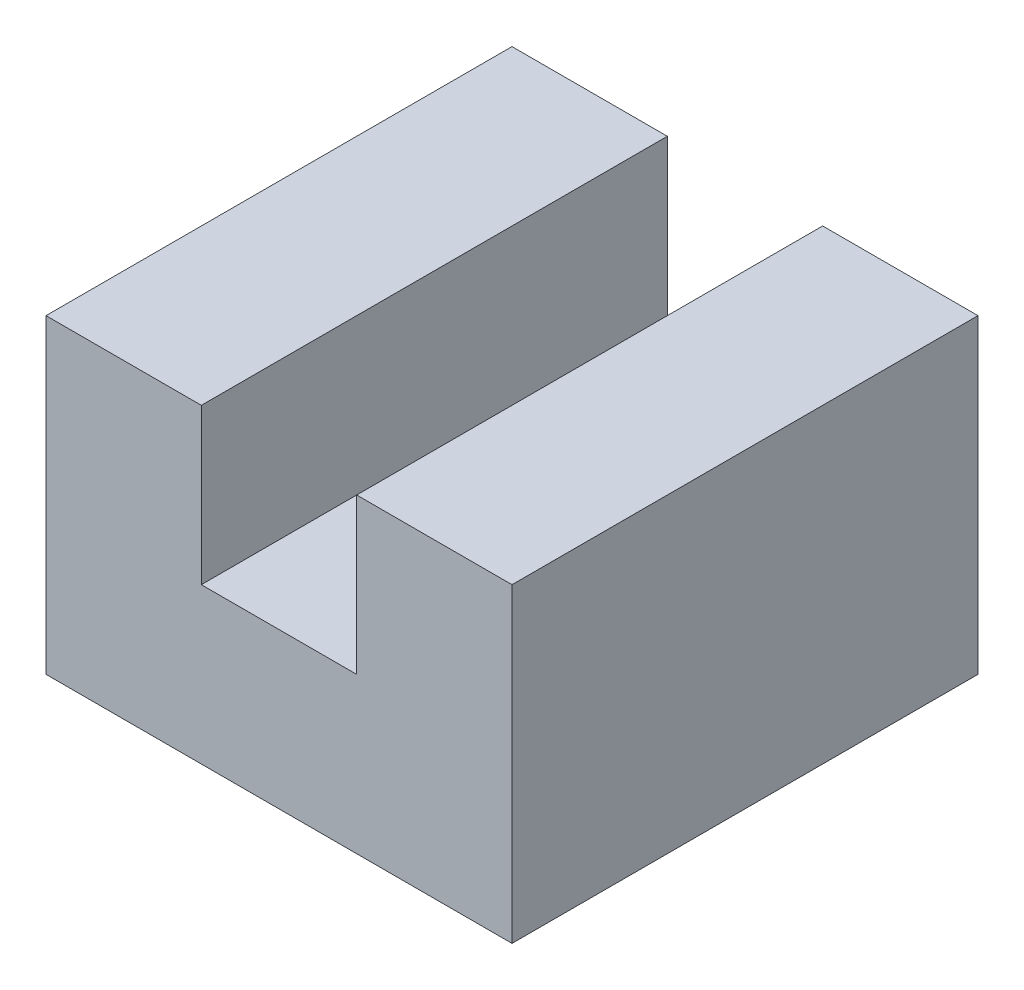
ISO-10303-21;
HEADER;
FILE_DESCRIPTION(('STEP AP214'),'2;1');
FILE_NAME('part.step','',(''),(''),'','','');
FILE_SCHEMA(('AUTOMOTIVE_DESIGN { 1 0 10303 214 1 1 1 1 }'));
ENDSEC;
DATA;
#1=APPLICATION_CONTEXT('core data for automotive mechanical design processes');
#2=APPLICATION_PROTOCOL_DEFINITION('international standard','automotive_design',2000,#1);
#3=PRODUCT_CONTEXT('',#1,'mechanical');
#4=PRODUCT('Part','Part','',(#3));
#5=PRODUCT_RELATED_PRODUCT_CATEGORY('part','',(#4));
#6=PRODUCT_DEFINITION_FORMATION('','',#4);
#7=PRODUCT_DEFINITION_CONTEXT('part definition',#1,'design');
#8=PRODUCT_DEFINITION('design','',#6,#7);
#9=PRODUCT_DEFINITION_SHAPE('','',#8);
#10=(LENGTH_UNIT() NAMED_UNIT(*) SI_UNIT(.MILLI.,.METRE.));
#11=(NAMED_UNIT(*) PLANE_ANGLE_UNIT() SI_UNIT($,.RADIAN.));
#12=(NAMED_UNIT(*) SI_UNIT($,.STERADIAN.) SOLID_ANGLE_UNIT());
#13=UNCERTAINTY_MEASURE_WITH_UNIT(LENGTH_MEASURE(1.E-05),#10,'distance_accuracy_value','');
#14=(GEOMETRIC_REPRESENTATION_CONTEXT(3) GLOBAL_UNCERTAINTY_ASSIGNED_CONTEXT((#13)) GLOBAL_UNIT_ASSIGNED_CONTEXT((#10,
#11,#12)) REPRESENTATION_CONTEXT('',''));
#15=CARTESIAN_POINT('',(0.,0.,0.));
#16=DIRECTION('',(0.,0.,1.));
#17=DIRECTION('',(1.,0.,0.));
#18=AXIS2_PLACEMENT_3D('',#15,#16,#17);
#19=CARTESIAN_POINT('',(60.,0.,60.));
#20=DIRECTION('',(0.,1.,0.));
#21=DIRECTION('',(-1.,0.,0.));
#22=AXIS2_PLACEMENT_3D('',#19,#20,#21);
#23=PLANE('',#22);
#24=CARTESIAN_POINT('',(30.,0.,30.));
#25=DIRECTION('',(0.,-1.,0.));
#26=DIRECTION('',(1.,0.,0.));
#27=AXIS2_PLACEMENT_3D('',#24,#25,#26);
#28=CIRCLE('',#27,10.);
#29=CARTESIAN_POINT('',(40.,0.,30.));
#30=VERTEX_POINT('',#29);
#31=EDGE_CURVE('E177',#30,#30,#28,.T.);
#32=ORIENTED_EDGE('',*,*,#31,.F.);
#33=EDGE_LOOP('',(#32));
#34=FACE_BOUND('',#33,.T.);
#35=DIRECTION('',(1.,0.,0.));
#36=VECTOR('',#35,1.);
#37=CARTESIAN_POINT('',(60.,0.,0.));
#38=LINE('',#37,#36);
#39=CARTESIAN_POINT('',(0.,0.,0.));
#40=VERTEX_POINT('',#39);
#41=CARTESIAN_POINT('',(60.,0.,0.));
#42=VERTEX_POINT('',#41);
#43=EDGE_CURVE('E129',#40,#42,#38,.T.);
#44=ORIENTED_EDGE('',*,*,#43,.T.);
#45=DIRECTION('',(0.,0.,-1.));
#46=VECTOR('',#45,1.);
#47=CARTESIAN_POINT('',(60.,0.,60.));
#48=LINE('',#47,#46);
#49=CARTESIAN_POINT('',(60.,0.,60.));
#50=VERTEX_POINT('',#49);
#51=EDGE_CURVE('E11',#50,#42,#48,.T.);
#52=ORIENTED_EDGE('',*,*,#51,.F.);
#53=DIRECTION('',(1.,0.,0.));
#54=VECTOR('',#53,1.);
#55=CARTESIAN_POINT('',(60.,0.,60.));
#56=LINE('',#55,#54);
#57=CARTESIAN_POINT('',(0.,0.,60.));
#58=VERTEX_POINT('',#57);
#59=EDGE_CURVE('E144',#58,#50,#56,.T.);
#60=ORIENTED_EDGE('',*,*,#59,.F.);
#61=DIRECTION('',(0.,0.,-1.));
#62=VECTOR('',#61,1.);
#63=CARTESIAN_POINT('',(0.,0.,60.));
#64=LINE('',#63,#62);
#65=EDGE_CURVE('E125',#58,#40,#64,.T.);
#66=ORIENTED_EDGE('',*,*,#65,.T.);
#67=EDGE_LOOP('',(#44,#52,#60,#66));
#68=FACE_BOUND('',#67,.T.);
#69=ADVANCED_FACE('F33',(#34,#68),#23,.F.);
#70=CARTESIAN_POINT('',(60.,40.,60.));
#71=DIRECTION('',(-1.,0.,0.));
#72=DIRECTION('',(0.,0.,1.));
#73=AXIS2_PLACEMENT_3D('',#70,#71,#72);
#74=PLANE('',#73);
#75=DIRECTION('',(0.,1.,0.));
#76=VECTOR('',#75,1.);
#77=CARTESIAN_POINT('',(60.,40.,0.));
#78=LINE('',#77,#76);
#79=CARTESIAN_POINT('',(60.,40.,0.));
#80=VERTEX_POINT('',#79);
#81=EDGE_CURVE('E132',#42,#80,#78,.T.);
#82=ORIENTED_EDGE('',*,*,#81,.T.);
#83=DIRECTION('',(0.,0.,-1.));
#84=VECTOR('',#83,1.);
#85=CARTESIAN_POINT('',(60.,40.,60.));
#86=LINE('',#85,#84);
#87=CARTESIAN_POINT('',(60.,40.,60.));
#88=VERTEX_POINT('',#87);
#89=EDGE_CURVE('E41',#88,#80,#86,.T.);
#90=ORIENTED_EDGE('',*,*,#89,.F.);
#91=DIRECTION('',(0.,1.,0.));
#92=VECTOR('',#91,1.);
#93=CARTESIAN_POINT('',(60.,40.,60.));
#94=LINE('',#93,#92);
#95=EDGE_CURVE('E92',#50,#88,#94,.T.);
#96=ORIENTED_EDGE('',*,*,#95,.F.);
#97=ORIENTED_EDGE('',*,*,#51,.T.);
#98=EDGE_LOOP('',(#82,#90,#96,#97));
#99=FACE_BOUND('',#98,.T.);
#100=ADVANCED_FACE('F193',(#99),#74,.F.);
#101=CARTESIAN_POINT('',(40.,40.,60.));
#102=DIRECTION('',(0.,-1.,0.));
#103=DIRECTION('',(1.,0.,0.));
#104=AXIS2_PLACEMENT_3D('',#101,#102,#103);
#105=PLANE('',#104);
#106=DIRECTION('',(-1.,0.,0.));
#107=VECTOR('',#106,1.);
#108=CARTESIAN_POINT('',(40.,40.,0.));
#109=LINE('',#108,#107);
#110=CARTESIAN_POINT('',(40.,40.,0.));
#111=VERTEX_POINT('',#110);
#112=EDGE_CURVE('E135',#80,#111,#109,.T.);
#113=ORIENTED_EDGE('',*,*,#112,.T.);
#114=DIRECTION('',(0.,0.,-1.));
#115=VECTOR('',#114,1.);
#116=CARTESIAN_POINT('',(40.,40.,60.));
#117=LINE('',#116,#115);
#118=CARTESIAN_POINT('',(40.,40.,60.));
#119=VERTEX_POINT('',#118);
#120=EDGE_CURVE('E151',#119,#111,#117,.T.);
#121=ORIENTED_EDGE('',*,*,#120,.F.);
#122=DIRECTION('',(-1.,0.,0.));
#123=VECTOR('',#122,1.);
#124=CARTESIAN_POINT('',(40.,40.,60.));
#125=LINE('',#124,#123);
#126=EDGE_CURVE('E159',#88,#119,#125,.T.);
#127=ORIENTED_EDGE('',*,*,#126,.F.);
#128=ORIENTED_EDGE('',*,*,#89,.T.);
#129=EDGE_LOOP('',(#113,#121,#127,#128));
#130=FACE_BOUND('',#129,.T.);
#131=ADVANCED_FACE('F157',(#130),#105,.F.);
#132=CARTESIAN_POINT('',(40.,20.,60.));
#133=DIRECTION('',(1.,0.,0.));
#134=DIRECTION('',(0.,0.,-1.));
#135=AXIS2_PLACEMENT_3D('',#132,#133,#134);
#136=PLANE('',#135);
#137=DIRECTION('',(0.,-1.,0.));
#138=VECTOR('',#137,1.);
#139=CARTESIAN_POINT('',(40.,20.,0.));
#140=LINE('',#139,#138);
#141=CARTESIAN_POINT('',(40.,20.,0.));
#142=VERTEX_POINT('',#141);
#143=EDGE_CURVE('E137',#111,#142,#140,.T.);
#144=ORIENTED_EDGE('',*,*,#143,.T.);
#145=DIRECTION('',(0.,0.,-1.));
#146=VECTOR('',#145,1.);
#147=CARTESIAN_POINT('',(40.,20.,60.));
#148=LINE('',#147,#146);
#149=CARTESIAN_POINT('',(40.,20.,60.));
#150=VERTEX_POINT('',#149);
#151=EDGE_CURVE('E148',#150,#142,#148,.T.);
#152=ORIENTED_EDGE('',*,*,#151,.F.);
#153=DIRECTION('',(0.,-1.,0.));
#154=VECTOR('',#153,1.);
#155=CARTESIAN_POINT('',(40.,20.,60.));
#156=LINE('',#155,#154);
#157=EDGE_CURVE('E171',#119,#150,#156,.T.);
#158=ORIENTED_EDGE('',*,*,#157,.F.);
#159=ORIENTED_EDGE('',*,*,#120,.T.);
#160=EDGE_LOOP('',(#144,#152,#158,#159));
#161=FACE_BOUND('',#160,.T.);
#162=ADVANCED_FACE('F167',(#161),#136,.F.);
#163=CARTESIAN_POINT('',(20.,20.,60.));
#164=DIRECTION('',(0.,-1.,0.));
#165=DIRECTION('',(0.,0.,-1.));
#166=AXIS2_PLACEMENT_3D('',#163,#164,#165);
#167=PLANE('',#166);
#168=DIRECTION('',(-1.,0.,0.));
#169=VECTOR('',#168,1.);
#170=CARTESIAN_POINT('',(20.,20.,0.));
#171=LINE('',#170,#169);
#172=CARTESIAN_POINT('',(20.,20.,0.));
#173=VERTEX_POINT('',#172);
#174=EDGE_CURVE('E139',#142,#173,#171,.T.);
#175=ORIENTED_EDGE('',*,*,#174,.T.);
#176=DIRECTION('',(0.,0.,-1.));
#177=VECTOR('',#176,1.);
#178=CARTESIAN_POINT('',(20.,20.,60.));
#179=LINE('',#178,#177);
#180=CARTESIAN_POINT('',(20.,20.,60.));
#181=VERTEX_POINT('',#180);
#182=EDGE_CURVE('E120',#181,#173,#179,.T.);
#183=ORIENTED_EDGE('',*,*,#182,.F.);
#184=DIRECTION('',(-1.,0.,0.));
#185=VECTOR('',#184,1.);
#186=CARTESIAN_POINT('',(20.,20.,60.));
#187=LINE('',#186,#185);
#188=EDGE_CURVE('E111',#150,#181,#187,.T.);
#189=ORIENTED_EDGE('',*,*,#188,.F.);
#190=ORIENTED_EDGE('',*,*,#151,.T.);
#191=EDGE_LOOP('',(#175,#183,#189,#190));
#192=FACE_BOUND('',#191,.T.);
#193=ADVANCED_FACE('F170',(#192),#167,.F.);
#194=CARTESIAN_POINT('',(20.,40.,60.));
#195=DIRECTION('',(-1.,0.,0.));
#196=DIRECTION('',(0.,0.,1.));
#197=AXIS2_PLACEMENT_3D('',#194,#195,#196);
#198=PLANE('',#197);
#199=DIRECTION('',(0.,1.,0.));
#200=VECTOR('',#199,1.);
#201=CARTESIAN_POINT('',(20.,40.,0.));
#202=LINE('',#201,#200);
#203=CARTESIAN_POINT('',(20.,40.,0.));
#204=VERTEX_POINT('',#203);
#205=EDGE_CURVE('E119',#173,#204,#202,.T.);
#206=ORIENTED_EDGE('',*,*,#205,.T.);
#207=DIRECTION('',(0.,0.,-1.));
#208=VECTOR('',#207,1.);
#209=CARTESIAN_POINT('',(20.,40.,60.));
#210=LINE('',#209,#208);
#211=CARTESIAN_POINT('',(20.,40.,60.));
#212=VERTEX_POINT('',#211);
#213=EDGE_CURVE('E116',#212,#204,#210,.T.);
#214=ORIENTED_EDGE('',*,*,#213,.F.);
#215=DIRECTION('',(0.,1.,0.));
#216=VECTOR('',#215,1.);
#217=CARTESIAN_POINT('',(20.,40.,60.));
#218=LINE('',#217,#216);
#219=EDGE_CURVE('E105',#181,#212,#218,.T.);
#220=ORIENTED_EDGE('',*,*,#219,.F.);
#221=ORIENTED_EDGE('',*,*,#182,.T.);
#222=EDGE_LOOP('',(#206,#214,#220,#221));
#223=FACE_BOUND('',#222,.T.);
#224=ADVANCED_FACE('F117',(#223),#198,.F.);
#225=CARTESIAN_POINT('',(0.,40.,60.));
#226=DIRECTION('',(0.,-1.,0.));
#227=DIRECTION('',(0.,0.,-1.));
#228=AXIS2_PLACEMENT_3D('',#225,#226,#227);
#229=PLANE('',#228);
#230=DIRECTION('',(-1.,0.,0.));
#231=VECTOR('',#230,1.);
#232=CARTESIAN_POINT('',(0.,40.,0.));
#233=LINE('',#232,#231);
#234=CARTESIAN_POINT('',(0.,40.,0.));
#235=VERTEX_POINT('',#234);
#236=EDGE_CURVE('E78',#204,#235,#233,.T.);
#237=ORIENTED_EDGE('',*,*,#236,.T.);
#238=DIRECTION('',(0.,0.,-1.));
#239=VECTOR('',#238,1.);
#240=CARTESIAN_POINT('',(0.,40.,60.));
#241=LINE('',#240,#239);
#242=CARTESIAN_POINT('',(0.,40.,60.));
#243=VERTEX_POINT('',#242);
#244=EDGE_CURVE('E121',#243,#235,#241,.T.);
#245=ORIENTED_EDGE('',*,*,#244,.F.);
#246=DIRECTION('',(-1.,0.,0.));
#247=VECTOR('',#246,1.);
#248=CARTESIAN_POINT('',(0.,40.,60.));
#249=LINE('',#248,#247);
#250=EDGE_CURVE('E109',#212,#243,#249,.T.);
#251=ORIENTED_EDGE('',*,*,#250,.F.);
#252=ORIENTED_EDGE('',*,*,#213,.T.);
#253=EDGE_LOOP('',(#237,#245,#251,#252));
#254=FACE_BOUND('',#253,.T.);
#255=ADVANCED_FACE('F123',(#254),#229,.F.);
#256=CARTESIAN_POINT('',(0.,0.,60.));
#257=DIRECTION('',(1.,0.,0.));
#258=DIRECTION('',(0.,0.,-1.));
#259=AXIS2_PLACEMENT_3D('',#256,#257,#258);
#260=PLANE('',#259);
#261=DIRECTION('',(0.,-1.,0.));
#262=VECTOR('',#261,1.);
#263=CARTESIAN_POINT('',(0.,0.,0.));
#264=LINE('',#263,#262);
#265=EDGE_CURVE('E84',#235,#40,#264,.T.);
#266=ORIENTED_EDGE('',*,*,#265,.T.);
#267=ORIENTED_EDGE('',*,*,#65,.F.);
#268=DIRECTION('',(0.,-1.,0.));
#269=VECTOR('',#268,1.);
#270=CARTESIAN_POINT('',(0.,0.,60.));
#271=LINE('',#270,#269);
#272=EDGE_CURVE('E49',#243,#58,#271,.T.);
#273=ORIENTED_EDGE('',*,*,#272,.F.);
#274=ORIENTED_EDGE('',*,*,#244,.T.);
#275=EDGE_LOOP('',(#266,#267,#273,#274));
#276=FACE_BOUND('',#275,.T.);
#277=ADVANCED_FACE('F196',(#276),#260,.F.);
#278=CARTESIAN_POINT('',(0.,0.,60.));
#279=DIRECTION('',(0.,0.,-1.));
#280=DIRECTION('',(-1.,0.,0.));
#281=AXIS2_PLACEMENT_3D('',#278,#279,#280);
#282=PLANE('',#281);
#283=ORIENTED_EDGE('',*,*,#59,.T.);
#284=ORIENTED_EDGE('',*,*,#95,.T.);
#285=ORIENTED_EDGE('',*,*,#126,.T.);
#286=ORIENTED_EDGE('',*,*,#157,.T.);
#287=ORIENTED_EDGE('',*,*,#188,.T.);
#288=ORIENTED_EDGE('',*,*,#219,.T.);
#289=ORIENTED_EDGE('',*,*,#250,.T.);
#290=ORIENTED_EDGE('',*,*,#272,.T.);
#291=EDGE_LOOP('',(#283,#284,#285,#286,#287,#288,#289,#290));
#292=FACE_BOUND('',#291,.T.);
#293=ADVANCED_FACE('F107',(#292),#282,.F.);
#294=CARTESIAN_POINT('',(0.,0.,0.));
#295=DIRECTION('',(0.,0.,-1.));
#296=DIRECTION('',(-1.,0.,0.));
#297=AXIS2_PLACEMENT_3D('',#294,#295,#296);
#298=PLANE('',#297);
#299=ORIENTED_EDGE('',*,*,#43,.F.);
#300=ORIENTED_EDGE('',*,*,#265,.F.);
#301=ORIENTED_EDGE('',*,*,#236,.F.);
#302=ORIENTED_EDGE('',*,*,#205,.F.);
#303=ORIENTED_EDGE('',*,*,#174,.F.);
#304=ORIENTED_EDGE('',*,*,#143,.F.);
#305=ORIENTED_EDGE('',*,*,#112,.F.);
#306=ORIENTED_EDGE('',*,*,#81,.F.);
#307=EDGE_LOOP('',(#299,#300,#301,#302,#303,#304,#305,#306));
#308=FACE_BOUND('',#307,.T.);
#309=ADVANCED_FACE('F163',(#308),#298,.T.);
#310=CARTESIAN_POINT('',(30.,15.,30.));
#311=DIRECTION('',(0.,-1.,0.));
#312=DIRECTION('',(1.,0.,0.));
#313=AXIS2_PLACEMENT_3D('',#310,#311,#312);
#314=CYLINDRICAL_SURFACE('',#313,10.);
#315=CARTESIAN_POINT('',(30.,15.,30.));
#316=DIRECTION('',(0.,-1.,0.));
#317=DIRECTION('',(1.,0.,0.));
#318=AXIS2_PLACEMENT_3D('',#315,#316,#317);
#319=CIRCLE('',#318,10.);
#320=CARTESIAN_POINT('',(40.,15.,30.));
#321=VERTEX_POINT('',#320);
#322=EDGE_CURVE('E133',#321,#321,#319,.T.);
#323=ORIENTED_EDGE('',*,*,#322,.F.);
#324=EDGE_LOOP('',(#323));
#325=FACE_BOUND('',#324,.T.);
#326=ORIENTED_EDGE('',*,*,#31,.T.);
#327=EDGE_LOOP('',(#326));
#328=FACE_BOUND('',#327,.T.);
#329=ADVANCED_FACE('F185',(#325,#328),#314,.F.);
#330=CARTESIAN_POINT('',(30.,15.,30.));
#331=DIRECTION('',(0.,-1.,0.));
#332=DIRECTION('',(1.,0.,0.));
#333=AXIS2_PLACEMENT_3D('',#330,#331,#332);
#334=PLANE('',#333);
#335=ORIENTED_EDGE('',*,*,#322,.T.);
#336=EDGE_LOOP('',(#335));
#337=FACE_BOUND('',#336,.T.);
#338=ADVANCED_FACE('F183',(#337),#334,.T.);
#339=CLOSED_SHELL('',(#69,#100,#131,#162,#193,#224,#255,#277,#293,#309,#329,#338));
#340=MANIFOLD_SOLID_BREP('B2',#339);
#341=ADVANCED_BREP_SHAPE_REPRESENTATION('',(#18,#340),#14);
#342=SHAPE_DEFINITION_REPRESENTATION(#9,#341);
ENDSEC;
END-ISO-10303-21;
